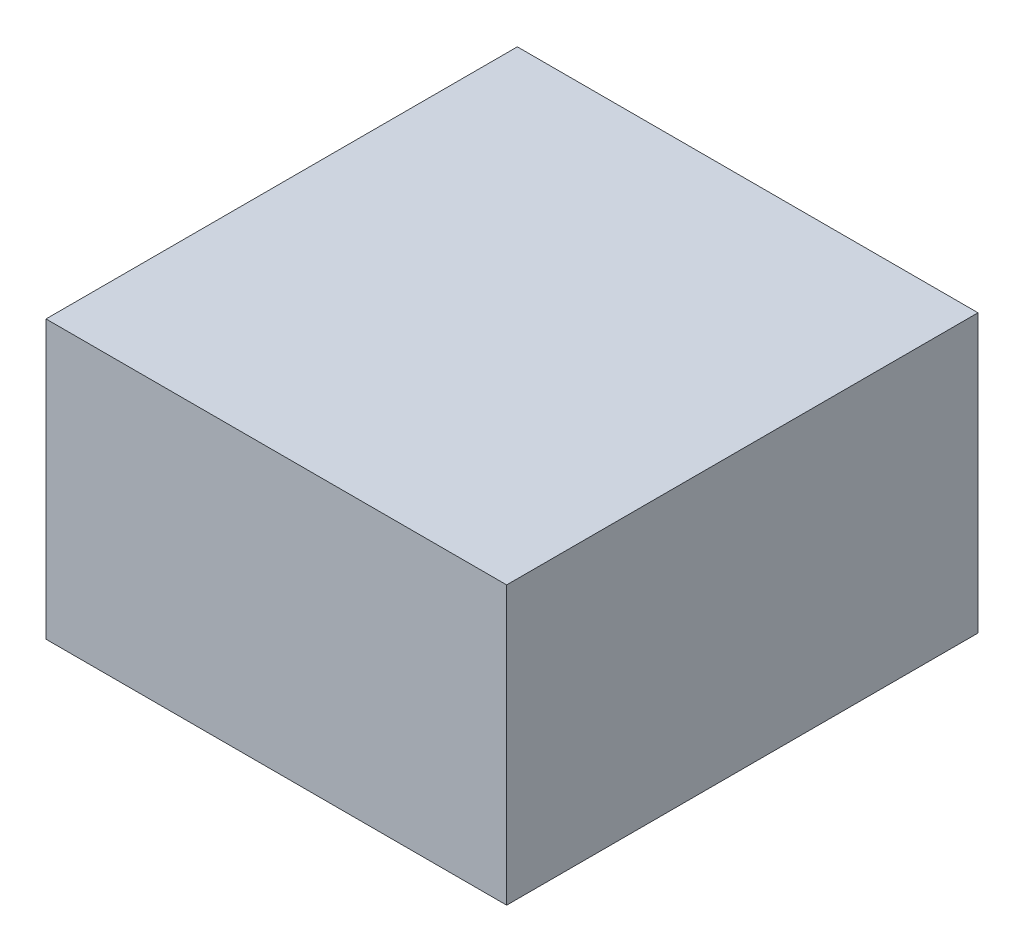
ISO-10303-21;
HEADER;
FILE_DESCRIPTION(('STEP AP214'),'2;1');
FILE_NAME('part.step','',(''),(''),'','','');
FILE_SCHEMA(('AUTOMOTIVE_DESIGN { 1 0 10303 214 1 1 1 1 }'));
ENDSEC;
DATA;
#1=APPLICATION_CONTEXT('core data for automotive mechanical design processes');
#2=APPLICATION_PROTOCOL_DEFINITION('international standard','automotive_design',2000,#1);
#3=PRODUCT_CONTEXT('',#1,'mechanical');
#4=PRODUCT('Part','Part','',(#3));
#5=PRODUCT_RELATED_PRODUCT_CATEGORY('part','',(#4));
#6=PRODUCT_DEFINITION_FORMATION('','',#4);
#7=PRODUCT_DEFINITION_CONTEXT('part definition',#1,'design');
#8=PRODUCT_DEFINITION('design','',#6,#7);
#9=PRODUCT_DEFINITION_SHAPE('','',#8);
#10=(LENGTH_UNIT() NAMED_UNIT(*) SI_UNIT(.MILLI.,.METRE.));
#11=(NAMED_UNIT(*) PLANE_ANGLE_UNIT() SI_UNIT($,.RADIAN.));
#12=(NAMED_UNIT(*) SI_UNIT($,.STERADIAN.) SOLID_ANGLE_UNIT());
#13=UNCERTAINTY_MEASURE_WITH_UNIT(LENGTH_MEASURE(1.E-05),#10,'distance_accuracy_value','');
#14=(GEOMETRIC_REPRESENTATION_CONTEXT(3) GLOBAL_UNCERTAINTY_ASSIGNED_CONTEXT((#13)) GLOBAL_UNIT_ASSIGNED_CONTEXT((#10,
#11,#12)) REPRESENTATION_CONTEXT('',''));
#15=CARTESIAN_POINT('',(0.,0.,0.));
#16=DIRECTION('',(0.,0.,1.));
#17=DIRECTION('',(1.,0.,0.));
#18=AXIS2_PLACEMENT_3D('',#15,#16,#17);
#19=CARTESIAN_POINT('',(-52.3065313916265,149.745946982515,-34.0091881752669));
#20=DIRECTION('',(0.,-1.,0.));
#21=DIRECTION('',(0.,0.,-1.));
#22=AXIS2_PLACEMENT_3D('',#19,#20,#21);
#23=PLANE('',#22);
#24=DIRECTION('',(1.,0.,0.));
#25=VECTOR('',#24,1.);
#26=CARTESIAN_POINT('',(-52.3065313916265,149.745946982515,-34.0091881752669));
#27=LINE('',#26,#25);
#28=CARTESIAN_POINT('',(-63.082516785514,149.745946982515,-34.0091881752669));
#29=VERTEX_POINT('',#28);
#30=CARTESIAN_POINT('',(-41.530545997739,149.745946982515,-34.0091881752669));
#31=VERTEX_POINT('',#30);
#32=EDGE_CURVE('E67',#29,#31,#27,.T.);
#33=ORIENTED_EDGE('',*,*,#32,.T.);
#34=DIRECTION('',(0.,0.,-1.));
#35=VECTOR('',#34,1.);
#36=CARTESIAN_POINT('',(-41.530545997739,149.745946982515,-34.0091881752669));
#37=LINE('',#36,#35);
#38=CARTESIAN_POINT('',(-41.530545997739,149.745946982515,-11.9576117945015));
#39=VERTEX_POINT('',#38);
#40=EDGE_CURVE('E54',#39,#31,#37,.T.);
#41=ORIENTED_EDGE('',*,*,#40,.F.);
#42=DIRECTION('',(1.,0.,0.));
#43=VECTOR('',#42,1.);
#44=CARTESIAN_POINT('',(-52.3065313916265,149.745946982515,-11.9576117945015));
#45=LINE('',#44,#43);
#46=CARTESIAN_POINT('',(-63.082516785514,149.745946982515,-11.9576117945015));
#47=VERTEX_POINT('',#46);
#48=EDGE_CURVE('E19',#47,#39,#45,.T.);
#49=ORIENTED_EDGE('',*,*,#48,.F.);
#50=DIRECTION('',(0.,0.,1.));
#51=VECTOR('',#50,1.);
#52=CARTESIAN_POINT('',(-63.082516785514,149.745946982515,-34.0091881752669));
#53=LINE('',#52,#51);
#54=EDGE_CURVE('E80',#29,#47,#53,.T.);
#55=ORIENTED_EDGE('',*,*,#54,.F.);
#56=EDGE_LOOP('',(#33,#41,#49,#55));
#57=FACE_BOUND('',#56,.T.);
#58=ADVANCED_FACE('F16',(#57),#23,.T.);
#59=CARTESIAN_POINT('',(-52.3065313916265,156.234677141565,-11.9576117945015));
#60=DIRECTION('',(0.,0.,1.));
#61=DIRECTION('',(1.,0.,0.));
#62=AXIS2_PLACEMENT_3D('',#59,#60,#61);
#63=PLANE('',#62);
#64=DIRECTION('',(0.,1.,0.));
#65=VECTOR('',#64,1.);
#66=CARTESIAN_POINT('',(-41.530545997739,156.234677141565,-11.9576117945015));
#67=LINE('',#66,#65);
#68=CARTESIAN_POINT('',(-41.530545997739,162.723407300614,-11.9576117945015));
#69=VERTEX_POINT('',#68);
#70=EDGE_CURVE('E60',#69,#39,#67,.F.);
#71=ORIENTED_EDGE('',*,*,#70,.F.);
#72=DIRECTION('',(1.,0.,0.));
#73=VECTOR('',#72,1.);
#74=CARTESIAN_POINT('',(-52.3065313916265,162.723407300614,-11.9576117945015));
#75=LINE('',#74,#73);
#76=CARTESIAN_POINT('',(-63.082516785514,162.723407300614,-11.9576117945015));
#77=VERTEX_POINT('',#76);
#78=EDGE_CURVE('E82',#77,#69,#75,.T.);
#79=ORIENTED_EDGE('',*,*,#78,.F.);
#80=DIRECTION('',(0.,1.,0.));
#81=VECTOR('',#80,1.);
#82=CARTESIAN_POINT('',(-63.082516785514,156.234677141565,-11.9576117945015));
#83=LINE('',#82,#81);
#84=EDGE_CURVE('E63',#47,#77,#83,.T.);
#85=ORIENTED_EDGE('',*,*,#84,.F.);
#86=ORIENTED_EDGE('',*,*,#48,.T.);
#87=EDGE_LOOP('',(#71,#79,#85,#86));
#88=FACE_BOUND('',#87,.T.);
#89=ADVANCED_FACE('F59',(#88),#63,.T.);
#90=CARTESIAN_POINT('',(-41.530545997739,156.234677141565,-34.0091881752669));
#91=DIRECTION('',(1.,0.,0.));
#92=DIRECTION('',(0.,0.,-1.));
#93=AXIS2_PLACEMENT_3D('',#90,#91,#92);
#94=PLANE('',#93);
#95=DIRECTION('',(0.,1.,0.));
#96=VECTOR('',#95,1.);
#97=CARTESIAN_POINT('',(-41.530545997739,156.234677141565,-34.0091881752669));
#98=LINE('',#97,#96);
#99=CARTESIAN_POINT('',(-41.530545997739,162.723407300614,-34.0091881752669));
#100=VERTEX_POINT('',#99);
#101=EDGE_CURVE('E69',#31,#100,#98,.T.);
#102=ORIENTED_EDGE('',*,*,#101,.T.);
#103=DIRECTION('',(0.,0.,1.));
#104=VECTOR('',#103,1.);
#105=CARTESIAN_POINT('',(-41.530545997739,162.723407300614,-34.0091881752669));
#106=LINE('',#105,#104);
#107=EDGE_CURVE('E73',#69,#100,#106,.F.);
#108=ORIENTED_EDGE('',*,*,#107,.F.);
#109=ORIENTED_EDGE('',*,*,#70,.T.);
#110=ORIENTED_EDGE('',*,*,#40,.T.);
#111=EDGE_LOOP('',(#102,#108,#109,#110));
#112=FACE_BOUND('',#111,.T.);
#113=ADVANCED_FACE('F71',(#112),#94,.T.);
#114=CARTESIAN_POINT('',(-52.3065313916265,156.234677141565,-34.0091881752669));
#115=DIRECTION('',(0.,0.,1.));
#116=DIRECTION('',(1.,0.,0.));
#117=AXIS2_PLACEMENT_3D('',#114,#115,#116);
#118=PLANE('',#117);
#119=DIRECTION('',(0.,1.,0.));
#120=VECTOR('',#119,1.);
#121=CARTESIAN_POINT('',(-63.082516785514,156.234677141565,-34.0091881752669));
#122=LINE('',#121,#120);
#123=CARTESIAN_POINT('',(-63.082516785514,162.723407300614,-34.0091881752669));
#124=VERTEX_POINT('',#123);
#125=EDGE_CURVE('E34',#124,#29,#122,.F.);
#126=ORIENTED_EDGE('',*,*,#125,.F.);
#127=DIRECTION('',(1.,0.,0.));
#128=VECTOR('',#127,1.);
#129=CARTESIAN_POINT('',(-52.3065313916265,162.723407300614,-34.0091881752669));
#130=LINE('',#129,#128);
#131=EDGE_CURVE('E25',#100,#124,#130,.F.);
#132=ORIENTED_EDGE('',*,*,#131,.F.);
#133=ORIENTED_EDGE('',*,*,#101,.F.);
#134=ORIENTED_EDGE('',*,*,#32,.F.);
#135=EDGE_LOOP('',(#126,#132,#133,#134));
#136=FACE_BOUND('',#135,.T.);
#137=ADVANCED_FACE('F88',(#136),#118,.F.);
#138=CARTESIAN_POINT('',(-63.082516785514,156.234677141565,-34.0091881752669));
#139=DIRECTION('',(-1.,0.,0.));
#140=DIRECTION('',(0.,0.,1.));
#141=AXIS2_PLACEMENT_3D('',#138,#139,#140);
#142=PLANE('',#141);
#143=ORIENTED_EDGE('',*,*,#125,.T.);
#144=ORIENTED_EDGE('',*,*,#54,.T.);
#145=ORIENTED_EDGE('',*,*,#84,.T.);
#146=DIRECTION('',(0.,0.,1.));
#147=VECTOR('',#146,1.);
#148=CARTESIAN_POINT('',(-63.082516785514,162.723407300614,-34.0091881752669));
#149=LINE('',#148,#147);
#150=EDGE_CURVE('E10',#124,#77,#149,.T.);
#151=ORIENTED_EDGE('',*,*,#150,.F.);
#152=EDGE_LOOP('',(#143,#144,#145,#151));
#153=FACE_BOUND('',#152,.T.);
#154=ADVANCED_FACE('F90',(#153),#142,.T.);
#155=CARTESIAN_POINT('',(-52.3065313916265,162.723407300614,-34.0091881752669));
#156=DIRECTION('',(0.,1.,0.));
#157=DIRECTION('',(0.,0.,1.));
#158=AXIS2_PLACEMENT_3D('',#155,#156,#157);
#159=PLANE('',#158);
#160=ORIENTED_EDGE('',*,*,#131,.T.);
#161=ORIENTED_EDGE('',*,*,#150,.T.);
#162=ORIENTED_EDGE('',*,*,#78,.T.);
#163=ORIENTED_EDGE('',*,*,#107,.T.);
#164=EDGE_LOOP('',(#160,#161,#162,#163));
#165=FACE_BOUND('',#164,.T.);
#166=ADVANCED_FACE('F87',(#165),#159,.T.);
#167=CLOSED_SHELL('',(#58,#89,#113,#137,#154,#166));
#168=MANIFOLD_SOLID_BREP('B1',#167);
#169=ADVANCED_BREP_SHAPE_REPRESENTATION('',(#18,#168),#14);
#170=SHAPE_DEFINITION_REPRESENTATION(#9,#169);
ENDSEC;
END-ISO-10303-21;
